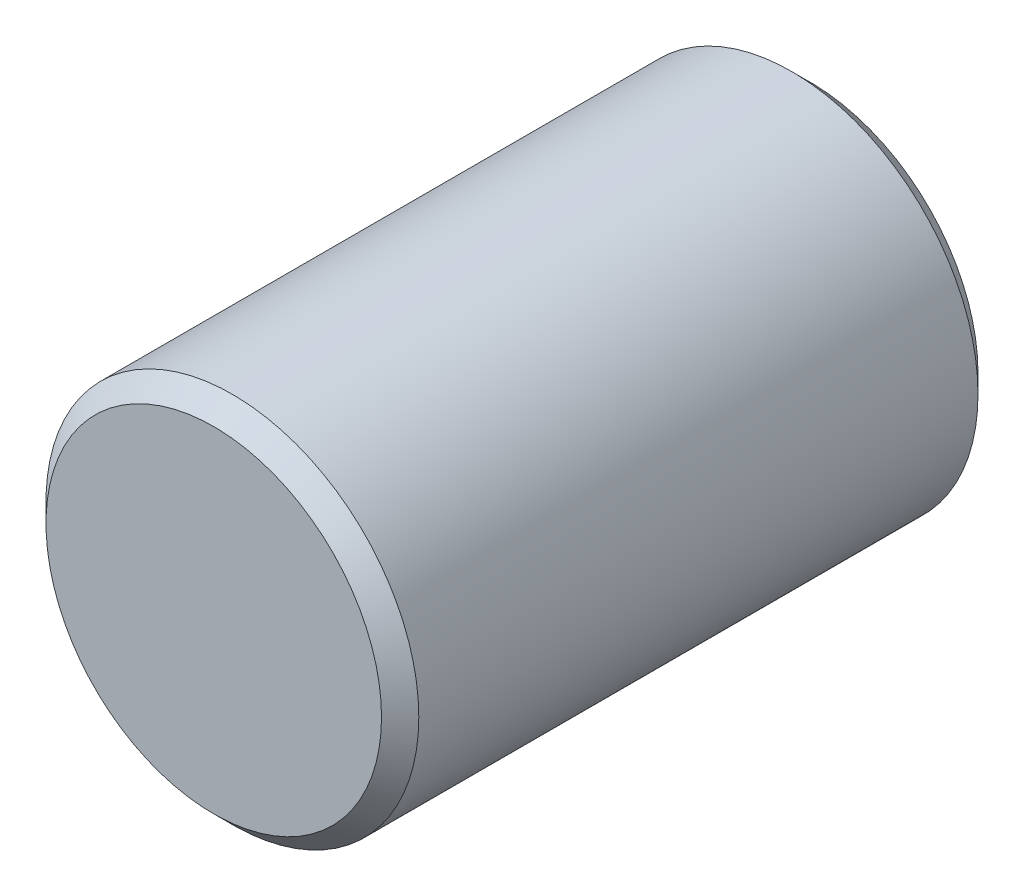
from build123d import *


with BuildPart() as part:
    # Sketch1 → Revolve1 (revolve)
    with BuildSketch(Plane(origin=(0, 0, 0), x_dir=(0, 0, -1), z_dir=(1, 0, 0)), mode=Mode.PRIVATE) as revolve1_sk:
        Polygon((0, 0), (8, 0), (8, 2.249986), (7.749986, 2.5), (0.250014, 2.5), (0, 2.249986), align=None)
    revolve(revolve1_sk.sketch.rotate(Axis((0, 0, -10.674691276), (0, 0, -1)), 90), axis=Axis((0, 0, -10.674691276), (0, 0, -1)))


solid = part.part
